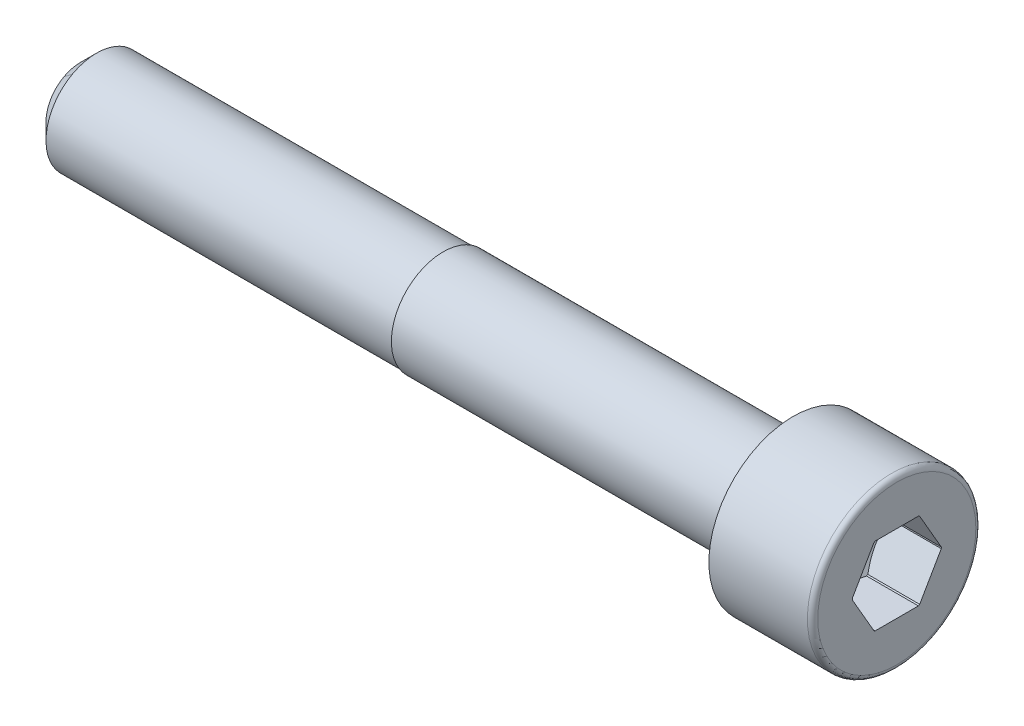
ISO-10303-21;
HEADER;
FILE_DESCRIPTION(('STEP AP214'),'2;1');
FILE_NAME('part.step','',(''),(''),'','','');
FILE_SCHEMA(('AUTOMOTIVE_DESIGN { 1 0 10303 214 1 1 1 1 }'));
ENDSEC;
DATA;
#1=APPLICATION_CONTEXT('core data for automotive mechanical design processes');
#2=APPLICATION_PROTOCOL_DEFINITION('international standard','automotive_design',2000,#1);
#3=PRODUCT_CONTEXT('',#1,'mechanical');
#4=PRODUCT('Part','Part','',(#3));
#5=PRODUCT_RELATED_PRODUCT_CATEGORY('part','',(#4));
#6=PRODUCT_DEFINITION_FORMATION('','',#4);
#7=PRODUCT_DEFINITION_CONTEXT('part definition',#1,'design');
#8=PRODUCT_DEFINITION('design','',#6,#7);
#9=PRODUCT_DEFINITION_SHAPE('','',#8);
#10=(LENGTH_UNIT() NAMED_UNIT(*) SI_UNIT(.MILLI.,.METRE.));
#11=(NAMED_UNIT(*) PLANE_ANGLE_UNIT() SI_UNIT($,.RADIAN.));
#12=(NAMED_UNIT(*) SI_UNIT($,.STERADIAN.) SOLID_ANGLE_UNIT());
#13=UNCERTAINTY_MEASURE_WITH_UNIT(LENGTH_MEASURE(1.E-05),#10,'distance_accuracy_value','');
#14=(GEOMETRIC_REPRESENTATION_CONTEXT(3) GLOBAL_UNCERTAINTY_ASSIGNED_CONTEXT((#13)) GLOBAL_UNIT_ASSIGNED_CONTEXT((#10,
#11,#12)) REPRESENTATION_CONTEXT('',''));
#15=CARTESIAN_POINT('',(0.,0.,0.));
#16=DIRECTION('',(0.,0.,1.));
#17=DIRECTION('',(1.,0.,0.));
#18=AXIS2_PLACEMENT_3D('',#15,#16,#17);
#19=CARTESIAN_POINT('',(5.00941127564,0.,0.));
#20=DIRECTION('',(-1.,0.,0.));
#21=DIRECTION('',(0.,0.,1.));
#22=AXIS2_PLACEMENT_3D('',#19,#20,#21);
#23=CYLINDRICAL_SURFACE('',#22,3.4315);
#24=DIRECTION('',(1.,0.,0.));
#25=VECTOR('',#24,1.);
#26=CARTESIAN_POINT('',(8.,3.,-1.66589082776));
#27=LINE('',#26,#25);
#28=CARTESIAN_POINT('',(4.00000000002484,3.,-1.66589082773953));
#29=VERTEX_POINT('',#28);
#30=CARTESIAN_POINT('',(8.,3.,-1.66589082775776));
#31=VERTEX_POINT('',#30);
#32=EDGE_CURVE('E153',#29,#31,#27,.T.);
#33=ORIENTED_EDGE('',*,*,#32,.F.);
#34=CARTESIAN_POINT('',(4.0000000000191,0.,0.));
#35=DIRECTION('',(1.,0.,0.));
#36=DIRECTION('',(0.,0.479425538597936,0.877582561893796));
#37=AXIS2_PLACEMENT_3D('',#34,#35,#36);
#38=CIRCLE('',#37,3.43149999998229);
#39=CARTESIAN_POINT('',(4.0000000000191,2.94270377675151,-1.76513079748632));
#40=VERTEX_POINT('',#39);
#41=EDGE_CURVE('E148',#29,#40,#38,.F.);
#42=ORIENTED_EDGE('',*,*,#41,.T.);
#43=DIRECTION('',(1.,0.,0.));
#44=VECTOR('',#43,1.);
#45=CARTESIAN_POINT('',(8.,2.94270377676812,-1.76513079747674));
#46=LINE('',#45,#44);
#47=CARTESIAN_POINT('',(8.,2.94270377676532,-1.76513079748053));
#48=VERTEX_POINT('',#47);
#49=EDGE_CURVE('E147',#48,#40,#46,.F.);
#50=ORIENTED_EDGE('',*,*,#49,.F.);
#51=CARTESIAN_POINT('',(8.,0.,0.));
#52=DIRECTION('',(1.,0.,0.));
#53=DIRECTION('',(0.,0.,-1.));
#54=AXIS2_PLACEMENT_3D('',#51,#52,#53);
#55=CIRCLE('',#54,3.4315);
#56=EDGE_CURVE('E132',#31,#48,#55,.F.);
#57=ORIENTED_EDGE('',*,*,#56,.F.);
#58=EDGE_LOOP('',(#33,#42,#50,#57));
#59=FACE_BOUND('',#58,.T.);
#60=ADVANCED_FACE('F16',(#59),#23,.F.);
#61=CARTESIAN_POINT('',(5.00941127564,0.,0.));
#62=DIRECTION('',(-1.,0.,0.));
#63=DIRECTION('',(0.,0.,1.));
#64=AXIS2_PLACEMENT_3D('',#61,#62,#63);
#65=CYLINDRICAL_SURFACE('',#64,3.4315);
#66=DIRECTION('',(1.,0.,0.));
#67=VECTOR('',#66,1.);
#68=CARTESIAN_POINT('',(8.,-0.0572962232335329,-3.43102162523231));
#69=LINE('',#68,#67);
#70=CARTESIAN_POINT('',(8.,-0.057296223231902,-3.43102162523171));
#71=VERTEX_POINT('',#70);
#72=CARTESIAN_POINT('',(4.0000000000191,-0.0572962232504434,-3.43102162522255));
#73=VERTEX_POINT('',#72);
#74=EDGE_CURVE('E392',#71,#73,#69,.F.);
#75=ORIENTED_EDGE('',*,*,#74,.F.);
#76=CARTESIAN_POINT('',(8.,0.,0.));
#77=DIRECTION('',(1.,0.,0.));
#78=DIRECTION('',(0.,0.,-1.));
#79=AXIS2_PLACEMENT_3D('',#76,#77,#78);
#80=CIRCLE('',#79,3.4315);
#81=CARTESIAN_POINT('',(8.,0.0572962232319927,-3.43102162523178));
#82=VERTEX_POINT('',#81);
#83=EDGE_CURVE('E144',#82,#71,#80,.F.);
#84=ORIENTED_EDGE('',*,*,#83,.F.);
#85=DIRECTION('',(1.,0.,0.));
#86=VECTOR('',#85,1.);
#87=CARTESIAN_POINT('',(8.,0.0572962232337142,-3.43102162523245));
#88=LINE('',#87,#86);
#89=CARTESIAN_POINT('',(4.00000000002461,0.0572962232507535,-3.43102162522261));
#90=VERTEX_POINT('',#89);
#91=EDGE_CURVE('E158',#90,#82,#88,.T.);
#92=ORIENTED_EDGE('',*,*,#91,.F.);
#93=CARTESIAN_POINT('',(4.0000000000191,0.,0.));
#94=DIRECTION('',(1.,0.,0.));
#95=DIRECTION('',(0.,0.479425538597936,0.877582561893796));
#96=AXIS2_PLACEMENT_3D('',#93,#94,#95);
#97=CIRCLE('',#96,3.43149999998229);
#98=EDGE_CURVE('E168',#90,#73,#97,.F.);
#99=ORIENTED_EDGE('',*,*,#98,.T.);
#100=EDGE_LOOP('',(#75,#84,#92,#99));
#101=FACE_BOUND('',#100,.T.);
#102=ADVANCED_FACE('F427',(#101),#65,.F.);
#103=CARTESIAN_POINT('',(5.00941127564,0.,0.));
#104=DIRECTION('',(-1.,0.,0.));
#105=DIRECTION('',(0.,0.,1.));
#106=AXIS2_PLACEMENT_3D('',#103,#104,#105);
#107=CYLINDRICAL_SURFACE('',#106,3.4315);
#108=CARTESIAN_POINT('',(4.0000000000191,0.,0.));
#109=DIRECTION('',(1.,0.,0.));
#110=DIRECTION('',(0.,0.479425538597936,0.877582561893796));
#111=AXIS2_PLACEMENT_3D('',#108,#109,#110);
#112=CIRCLE('',#111,3.43149999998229);
#113=CARTESIAN_POINT('',(4.00000000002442,-2.94270377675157,-1.76513079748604));
#114=VERTEX_POINT('',#113);
#115=CARTESIAN_POINT('',(4.0000000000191,-3.,-1.66589082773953));
#116=VERTEX_POINT('',#115);
#117=EDGE_CURVE('E270',#114,#116,#112,.F.);
#118=ORIENTED_EDGE('',*,*,#117,.T.);
#119=DIRECTION('',(1.,0.,0.));
#120=VECTOR('',#119,1.);
#121=CARTESIAN_POINT('',(8.,-3.,-1.66589082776));
#122=LINE('',#121,#120);
#123=CARTESIAN_POINT('',(8.,-3.,-1.66589082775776));
#124=VERTEX_POINT('',#123);
#125=EDGE_CURVE('E241',#124,#116,#122,.F.);
#126=ORIENTED_EDGE('',*,*,#125,.F.);
#127=CARTESIAN_POINT('',(8.,0.,0.));
#128=DIRECTION('',(1.,0.,0.));
#129=DIRECTION('',(0.,0.,-1.));
#130=AXIS2_PLACEMENT_3D('',#127,#128,#129);
#131=CIRCLE('',#130,3.4315);
#132=CARTESIAN_POINT('',(8.,-2.94270377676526,-1.76513079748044));
#133=VERTEX_POINT('',#132);
#134=EDGE_CURVE('E273',#133,#124,#131,.F.);
#135=ORIENTED_EDGE('',*,*,#134,.F.);
#136=DIRECTION('',(1.,0.,0.));
#137=VECTOR('',#136,1.);
#138=CARTESIAN_POINT('',(8.,-2.94270377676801,-1.76513079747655));
#139=LINE('',#138,#137);
#140=EDGE_CURVE('E389',#114,#133,#139,.T.);
#141=ORIENTED_EDGE('',*,*,#140,.F.);
#142=EDGE_LOOP('',(#118,#126,#135,#141));
#143=FACE_BOUND('',#142,.T.);
#144=ADVANCED_FACE('F416',(#143),#107,.F.);
#145=CARTESIAN_POINT('',(5.00941127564,0.,0.));
#146=DIRECTION('',(-1.,0.,0.));
#147=DIRECTION('',(0.,0.,1.));
#148=AXIS2_PLACEMENT_3D('',#145,#146,#147);
#149=CYLINDRICAL_SURFACE('',#148,3.4315);
#150=DIRECTION('',(1.,0.,0.));
#151=VECTOR('',#150,1.);
#152=CARTESIAN_POINT('',(8.,-3.,1.66589082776));
#153=LINE('',#152,#151);
#154=CARTESIAN_POINT('',(4.00000000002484,-3.,1.66589082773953));
#155=VERTEX_POINT('',#154);
#156=CARTESIAN_POINT('',(8.,-3.,1.66589082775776));
#157=VERTEX_POINT('',#156);
#158=EDGE_CURVE('E240',#155,#157,#153,.T.);
#159=ORIENTED_EDGE('',*,*,#158,.F.);
#160=CARTESIAN_POINT('',(4.0000000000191,0.,0.));
#161=DIRECTION('',(1.,0.,0.));
#162=DIRECTION('',(0.,0.479425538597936,0.877582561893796));
#163=AXIS2_PLACEMENT_3D('',#160,#161,#162);
#164=CIRCLE('',#163,3.43149999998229);
#165=CARTESIAN_POINT('',(4.0000000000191,-2.94270377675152,1.76513079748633));
#166=VERTEX_POINT('',#165);
#167=EDGE_CURVE('E406',#155,#166,#164,.F.);
#168=ORIENTED_EDGE('',*,*,#167,.T.);
#169=DIRECTION('',(1.,0.,0.));
#170=VECTOR('',#169,1.);
#171=CARTESIAN_POINT('',(8.,-2.94270377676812,1.76513079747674));
#172=LINE('',#171,#170);
#173=CARTESIAN_POINT('',(8.,-2.94270377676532,1.76513079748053));
#174=VERTEX_POINT('',#173);
#175=EDGE_CURVE('E382',#174,#166,#172,.F.);
#176=ORIENTED_EDGE('',*,*,#175,.F.);
#177=CARTESIAN_POINT('',(8.,0.,0.));
#178=DIRECTION('',(1.,0.,0.));
#179=DIRECTION('',(0.,0.,-1.));
#180=AXIS2_PLACEMENT_3D('',#177,#178,#179);
#181=CIRCLE('',#180,3.4315);
#182=EDGE_CURVE('E271',#157,#174,#181,.F.);
#183=ORIENTED_EDGE('',*,*,#182,.F.);
#184=EDGE_LOOP('',(#159,#168,#176,#183));
#185=FACE_BOUND('',#184,.T.);
#186=ADVANCED_FACE('F441',(#185),#149,.F.);
#187=CARTESIAN_POINT('',(5.00941127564,0.,0.));
#188=DIRECTION('',(-1.,0.,0.));
#189=DIRECTION('',(0.,0.,1.));
#190=AXIS2_PLACEMENT_3D('',#187,#188,#189);
#191=CYLINDRICAL_SURFACE('',#190,3.4315);
#192=DIRECTION('',(1.,0.,0.));
#193=VECTOR('',#192,1.);
#194=CARTESIAN_POINT('',(8.,0.0572962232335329,3.43102162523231));
#195=LINE('',#194,#193);
#196=CARTESIAN_POINT('',(8.,0.057296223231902,3.43102162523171));
#197=VERTEX_POINT('',#196);
#198=CARTESIAN_POINT('',(4.0000000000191,0.0572962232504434,3.43102162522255));
#199=VERTEX_POINT('',#198);
#200=EDGE_CURVE('E197',#197,#199,#195,.F.);
#201=ORIENTED_EDGE('',*,*,#200,.F.);
#202=CARTESIAN_POINT('',(8.,0.,0.));
#203=DIRECTION('',(1.,0.,0.));
#204=DIRECTION('',(0.,0.,-1.));
#205=AXIS2_PLACEMENT_3D('',#202,#203,#204);
#206=CIRCLE('',#205,3.4315);
#207=CARTESIAN_POINT('',(8.,-0.0572962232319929,3.43102162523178));
#208=VERTEX_POINT('',#207);
#209=EDGE_CURVE('E268',#208,#197,#206,.F.);
#210=ORIENTED_EDGE('',*,*,#209,.F.);
#211=DIRECTION('',(1.,0.,0.));
#212=VECTOR('',#211,1.);
#213=CARTESIAN_POINT('',(8.,-0.0572962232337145,3.43102162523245));
#214=LINE('',#213,#212);
#215=CARTESIAN_POINT('',(4.00000000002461,-0.057296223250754,3.43102162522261));
#216=VERTEX_POINT('',#215);
#217=EDGE_CURVE('E379',#216,#208,#214,.T.);
#218=ORIENTED_EDGE('',*,*,#217,.F.);
#219=CARTESIAN_POINT('',(4.0000000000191,0.,0.));
#220=DIRECTION('',(1.,0.,0.));
#221=DIRECTION('',(0.,0.479425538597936,0.877582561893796));
#222=AXIS2_PLACEMENT_3D('',#219,#220,#221);
#223=CIRCLE('',#222,3.43149999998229);
#224=EDGE_CURVE('E169',#216,#199,#223,.F.);
#225=ORIENTED_EDGE('',*,*,#224,.T.);
#226=EDGE_LOOP('',(#201,#210,#218,#225));
#227=FACE_BOUND('',#226,.T.);
#228=ADVANCED_FACE('F213',(#227),#191,.F.);
#229=CARTESIAN_POINT('',(4.0000000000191,0.,0.));
#230=DIRECTION('',(1.,0.,0.));
#231=DIRECTION('',(0.,0.,-1.));
#232=AXIS2_PLACEMENT_3D('',#229,#230,#231);
#233=CONICAL_SURFACE('',#232,3.43149999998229,1.0471975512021);
#234=CARTESIAN_POINT('',(2.02219020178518,-3.92209341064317E-12,2.14264945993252E-12));
#235=VERTEX_POINT('',#234);
#236=VERTEX_LOOP('',#235);
#237=FACE_BOUND('',#236,.T.);
#238=CARTESIAN_POINT('',(4.00000000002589,0.0572962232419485,3.43102162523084));
#239=CARTESIAN_POINT('',(3.96325492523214,0.17081183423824,3.36548335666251));
#240=CARTESIAN_POINT('',(3.929566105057,0.28514686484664,3.29947199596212));
#241=CARTESIAN_POINT('',(3.86970967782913,0.515490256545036,3.16648317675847));
#242=CARTESIAN_POINT('',(3.8435558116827,0.631501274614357,3.09950418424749));
#243=CARTESIAN_POINT('',(3.80077359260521,0.862380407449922,2.96620605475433));
#244=CARTESIAN_POINT('',(3.78395759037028,0.977221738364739,2.899902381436));
#245=CARTESIAN_POINT('',(3.76016083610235,1.20757941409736,2.76690531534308));
#246=CARTESIAN_POINT('',(3.75317159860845,1.32309508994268,2.70021230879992));
#247=CARTESIAN_POINT('',(3.74938304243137,1.56424529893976,2.56098417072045));
#248=CARTESIAN_POINT('',(3.75351627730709,1.68989180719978,2.48844212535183));
#249=CARTESIAN_POINT('',(3.77363673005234,1.94058202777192,2.34370605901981));
#250=CARTESIAN_POINT('',(3.78963616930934,2.06562498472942,2.2715124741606));
#251=CARTESIAN_POINT('',(3.83267808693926,2.31719015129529,2.1262712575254));
#252=CARTESIAN_POINT('',(3.85996753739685,2.4436796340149,2.05324252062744));
#253=CARTESIAN_POINT('',(3.92364198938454,2.69467514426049,1.90833019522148));
#254=CARTESIAN_POINT('',(3.96000827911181,2.81918469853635,1.83644457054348));
#255=CARTESIAN_POINT('',(4.00000000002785,2.94270377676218,1.76513079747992));
#256=B_SPLINE_CURVE_WITH_KNOTS('',3,(#238,#239,#240,#241,#242,#243,#244,#245,#246,#247,#248,
#249,#250,#251,#252,#253,#254,#255),.UNSPECIFIED.,.F.,.F.,(4,2,2,2,2,2,2,2,4),(0.,
0.408481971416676,0.817704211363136,1.21837417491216,1.61869794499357,2.05360864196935,
2.48896789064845,2.93440148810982,3.3789243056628),.UNSPECIFIED.);
#257=CARTESIAN_POINT('',(4.00000000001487,2.94270377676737,1.76513079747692));
#258=VERTEX_POINT('',#257);
#259=EDGE_CURVE('E189',#199,#258,#256,.T.);
#260=ORIENTED_EDGE('',*,*,#259,.F.);
#261=ORIENTED_EDGE('',*,*,#224,.F.);
#262=CARTESIAN_POINT('',(4.00000000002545,-2.94270377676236,1.76513079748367));
#263=CARTESIAN_POINT('',(3.95761571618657,-2.8118234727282,1.84069457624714));
#264=CARTESIAN_POINT('',(3.9193099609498,-2.67981268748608,1.9169110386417));
#265=CARTESIAN_POINT('',(3.85299680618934,-2.41358638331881,2.07061686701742));
#266=CARTESIAN_POINT('',(3.82501189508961,-2.27936670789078,2.14810863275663));
#267=CARTESIAN_POINT('',(3.78220050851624,-2.01256396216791,2.30214726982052));
#268=CARTESIAN_POINT('',(3.76707654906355,-1.88001803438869,2.37867269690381));
#269=CARTESIAN_POINT('',(3.75031731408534,-1.61441682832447,2.53201762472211));
#270=CARTESIAN_POINT('',(3.74866675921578,-1.4813622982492,2.60883669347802));
#271=CARTESIAN_POINT('',(3.75800702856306,-1.240344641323,2.7479883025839));
#272=CARTESIAN_POINT('',(3.76670796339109,-1.13230895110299,2.81036273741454));
#273=CARTESIAN_POINT('',(3.79254998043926,-0.916926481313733,2.93471386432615));
#274=CARTESIAN_POINT('',(3.80969720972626,-0.809580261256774,2.99669023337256));
#275=CARTESIAN_POINT('',(3.8518773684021,-0.593876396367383,3.12122691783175));
#276=CARTESIAN_POINT('',(3.8770609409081,-0.485541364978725,3.18377417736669));
#277=CARTESIAN_POINT('',(3.93394629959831,-0.270335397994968,3.30802340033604));
#278=CARTESIAN_POINT('',(3.96563762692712,-0.163462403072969,3.36972655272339));
#279=CARTESIAN_POINT('',(4.00000000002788,-0.0572962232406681,3.43102162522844));
#280=B_SPLINE_CURVE_WITH_KNOTS('',3,(#262,#263,#264,#265,#266,#267,#268,#269,#270,#271,#272,
#273,#274,#275,#276,#277,#278,#279),.UNSPECIFIED.,.F.,.F.,(4,2,2,2,2,2,2,2,4),(0.,
0.471055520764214,0.943131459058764,1.40396540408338,1.86427667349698,2.23913478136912,
2.61426610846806,2.99688901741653,3.37890174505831),.UNSPECIFIED.);
#281=EDGE_CURVE('E198',#166,#216,#280,.T.);
#282=ORIENTED_EDGE('',*,*,#281,.F.);
#283=ORIENTED_EDGE('',*,*,#167,.F.);
#284=CARTESIAN_POINT('',(4.00000000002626,-3.000000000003,-1.66589082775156));
#285=CARTESIAN_POINT('',(3.95761571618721,-3.00000000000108,-1.51476327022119));
#286=CARTESIAN_POINT('',(3.91930996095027,-3.00000000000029,-1.36233034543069));
#287=CARTESIAN_POINT('',(3.85299680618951,-2.99999999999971,-1.05491868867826));
#288=CARTESIAN_POINT('',(3.82501189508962,-2.99999999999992,-0.899935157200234));
#289=CARTESIAN_POINT('',(3.78220050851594,-3.00000000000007,-0.591857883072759));
#290=CARTESIAN_POINT('',(3.76707654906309,-3.00000000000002,-0.438807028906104));
#291=CARTESIAN_POINT('',(3.75031731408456,-2.99999999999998,-0.132117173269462));
#292=CARTESIAN_POINT('',(3.74866675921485,-2.99999999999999,0.0215209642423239));
#293=CARTESIAN_POINT('',(3.75800702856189,-3.,0.299824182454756));
#294=CARTESIAN_POINT('',(3.76670796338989,-3.,0.424573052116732));
#295=CARTESIAN_POINT('',(3.79254998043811,-3.,0.673275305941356));
#296=CARTESIAN_POINT('',(3.80969720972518,-3.,0.797228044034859));
#297=CARTESIAN_POINT('',(3.85187736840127,-3.,1.04630141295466));
#298=CARTESIAN_POINT('',(3.87706094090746,-3.,1.17139593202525));
#299=CARTESIAN_POINT('',(3.93394629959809,-3.,1.41989437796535));
#300=CARTESIAN_POINT('',(3.96563762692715,-3.,1.54330068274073));
#301=CARTESIAN_POINT('',(4.00000000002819,-3.,1.6658908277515));
#302=B_SPLINE_CURVE_WITH_KNOTS('',3,(#284,#285,#286,#287,#288,#289,#290,#291,#292,#293,#294,
#295,#296,#297,#298,#299,#300,#301),.UNSPECIFIED.,.F.,.F.,(4,2,2,2,2,2,2,2,4),(0.,
0.471055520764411,0.943131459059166,1.40396540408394,1.86427667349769,2.23913478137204,
2.61426610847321,2.99688901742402,3.37890174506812),.UNSPECIFIED.);
#303=EDGE_CURVE('E234',#116,#155,#302,.T.);
#304=ORIENTED_EDGE('',*,*,#303,.F.);
#305=ORIENTED_EDGE('',*,*,#117,.F.);
#306=CARTESIAN_POINT('',(4.00000000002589,-0.0572962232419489,-3.43102162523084));
#307=CARTESIAN_POINT('',(3.96325492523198,-0.170811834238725,-3.36548335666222));
#308=CARTESIAN_POINT('',(3.92956610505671,-0.285146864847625,-3.29947199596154));
#309=CARTESIAN_POINT('',(3.86970967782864,-0.515490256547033,-3.16648317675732));
#310=CARTESIAN_POINT('',(3.84355581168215,-0.631501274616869,-3.09950418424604));
#311=CARTESIAN_POINT('',(3.80077359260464,-0.862380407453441,-2.96620605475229));
#312=CARTESIAN_POINT('',(3.78395759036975,-0.977221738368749,-2.89990238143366));
#313=CARTESIAN_POINT('',(3.76016083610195,-1.20757941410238,-2.7669053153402));
#314=CARTESIAN_POINT('',(3.75317159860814,-1.32309508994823,-2.70021230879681));
#315=CARTESIAN_POINT('',(3.74938304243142,-1.5642452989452,-2.56098417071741));
#316=CARTESIAN_POINT('',(3.75351627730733,-1.68989180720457,-2.4884421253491));
#317=CARTESIAN_POINT('',(3.77363673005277,-1.94058202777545,-2.34370605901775));
#318=CARTESIAN_POINT('',(3.78963616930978,-2.06562498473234,-2.27151247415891));
#319=CARTESIAN_POINT('',(3.83267808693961,-2.31719015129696,-2.12627125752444));
#320=CARTESIAN_POINT('',(3.8599675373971,-2.44367963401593,-2.05324252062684));
#321=CARTESIAN_POINT('',(3.92364198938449,-2.69467514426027,-1.9083301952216));
#322=CARTESIAN_POINT('',(3.96000827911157,-2.81918469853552,-1.83644457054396));
#323=CARTESIAN_POINT('',(4.00000000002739,-2.94270377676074,-1.76513079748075));
#324=B_SPLINE_CURVE_WITH_KNOTS('',3,(#306,#307,#308,#309,#310,#311,#312,#313,#314,#315,#316,
#317,#318,#319,#320,#321,#322,#323),.UNSPECIFIED.,.F.,.F.,(4,2,2,2,2,2,2,2,4),(0.,
0.408481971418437,0.817704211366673,1.2183741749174,1.6186979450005,2.05360864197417,
2.48896789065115,2.93440148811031,3.37892430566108),.UNSPECIFIED.);
#325=EDGE_CURVE('E229',#73,#114,#324,.T.);
#326=ORIENTED_EDGE('',*,*,#325,.F.);
#327=ORIENTED_EDGE('',*,*,#98,.F.);
#328=CARTESIAN_POINT('',(4.00000000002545,2.94270377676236,-1.76513079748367));
#329=CARTESIAN_POINT('',(3.95761571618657,2.8118234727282,-1.84069457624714));
#330=CARTESIAN_POINT('',(3.91930996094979,2.67981268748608,-1.9169110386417));
#331=CARTESIAN_POINT('',(3.85299680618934,2.41358638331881,-2.07061686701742));
#332=CARTESIAN_POINT('',(3.82501189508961,2.27936670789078,-2.14810863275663));
#333=CARTESIAN_POINT('',(3.78220050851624,2.0125639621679,-2.30214726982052));
#334=CARTESIAN_POINT('',(3.76707654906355,1.88001803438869,-2.37867269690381));
#335=CARTESIAN_POINT('',(3.75031731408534,1.61441682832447,-2.53201762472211));
#336=CARTESIAN_POINT('',(3.74866675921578,1.4813622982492,-2.60883669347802));
#337=CARTESIAN_POINT('',(3.75800702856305,1.240344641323,-2.7479883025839));
#338=CARTESIAN_POINT('',(3.76670796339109,1.13230895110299,-2.81036273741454));
#339=CARTESIAN_POINT('',(3.79254998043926,0.916926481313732,-2.93471386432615));
#340=CARTESIAN_POINT('',(3.80969720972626,0.809580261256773,-2.99669023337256));
#341=CARTESIAN_POINT('',(3.8518773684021,0.593876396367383,-3.12122691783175));
#342=CARTESIAN_POINT('',(3.8770609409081,0.485541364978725,-3.18377417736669));
#343=CARTESIAN_POINT('',(3.93394629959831,0.270335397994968,-3.30802340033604));
#344=CARTESIAN_POINT('',(3.96563762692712,0.163462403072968,-3.36972655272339));
#345=CARTESIAN_POINT('',(4.00000000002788,0.0572962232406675,-3.43102162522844));
#346=B_SPLINE_CURVE_WITH_KNOTS('',3,(#328,#329,#330,#331,#332,#333,#334,#335,#336,#337,#338,
#339,#340,#341,#342,#343,#344,#345),.UNSPECIFIED.,.F.,.F.,(4,2,2,2,2,2,2,2,4),(0.,
0.471055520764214,0.943131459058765,1.40396540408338,1.86427667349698,2.23913478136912,
2.61426610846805,2.99688901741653,3.37890174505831),.UNSPECIFIED.);
#347=EDGE_CURVE('E152',#40,#90,#346,.T.);
#348=ORIENTED_EDGE('',*,*,#347,.F.);
#349=ORIENTED_EDGE('',*,*,#41,.F.);
#350=CARTESIAN_POINT('',(4.00000000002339,3.00000000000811,1.66589082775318));
#351=CARTESIAN_POINT('',(3.95761571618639,3.00000000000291,1.51476327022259));
#352=CARTESIAN_POINT('',(3.91930996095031,3.00000000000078,1.36233034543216));
#353=CARTESIAN_POINT('',(3.85299680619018,2.99999999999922,1.05491868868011));
#354=CARTESIAN_POINT('',(3.82501189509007,2.99999999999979,0.899935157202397));
#355=CARTESIAN_POINT('',(3.78220050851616,3.0000000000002,0.591857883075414));
#356=CARTESIAN_POINT('',(3.76707654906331,3.00000000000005,0.438807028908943));
#357=CARTESIAN_POINT('',(3.75031731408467,2.99999999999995,0.132117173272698));
#358=CARTESIAN_POINT('',(3.74866675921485,2.99999999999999,-0.021520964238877));
#359=CARTESIAN_POINT('',(3.75800702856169,3.00000000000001,-0.299824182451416));
#360=CARTESIAN_POINT('',(3.76670796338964,3.,-0.424573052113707));
#361=CARTESIAN_POINT('',(3.7925499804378,3.,-0.673275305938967));
#362=CARTESIAN_POINT('',(3.80969720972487,3.,-0.797228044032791));
#363=CARTESIAN_POINT('',(3.85187736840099,3.,-1.04630141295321));
#364=CARTESIAN_POINT('',(3.87706094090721,3.,-1.1713959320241));
#365=CARTESIAN_POINT('',(3.93394629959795,3.,-1.41989437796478));
#366=CARTESIAN_POINT('',(3.96563762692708,3.,-1.54330068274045));
#367=CARTESIAN_POINT('',(4.00000000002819,3.,-1.6658908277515));
#368=B_SPLINE_CURVE_WITH_KNOTS('',3,(#350,#351,#352,#353,#354,#355,#356,#357,#358,#359,#360,
#361,#362,#363,#364,#365,#366,#367),.UNSPECIFIED.,.F.,.F.,(4,2,2,2,2,2,2,2,4),(0.,
0.471055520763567,0.943131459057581,1.40396540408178,1.86427667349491,2.23913478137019,
2.61426610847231,2.99688901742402,3.378901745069),.UNSPECIFIED.);
#369=CARTESIAN_POINT('',(4.00000000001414,3.,1.6658908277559));
#370=VERTEX_POINT('',#369);
#371=EDGE_CURVE('E258',#370,#29,#368,.T.);
#372=ORIENTED_EDGE('',*,*,#371,.F.);
#373=CARTESIAN_POINT('',(4.,0.,0.));
#374=DIRECTION('',(-1.,0.,0.));
#375=DIRECTION('',(0.,0.,1.));
#376=AXIS2_PLACEMENT_3D('',#373,#374,#375);
#377=CIRCLE('',#376,3.4315);
#378=EDGE_CURVE('E267',#370,#258,#377,.F.);
#379=ORIENTED_EDGE('',*,*,#378,.T.);
#380=EDGE_LOOP('',(#260,#261,#282,#283,#304,#305,#326,#327,#348,#349,#372,#379));
#381=FACE_BOUND('',#380,.T.);
#382=ADVANCED_FACE('F207',(#237,#381),#233,.F.);
#383=CARTESIAN_POINT('',(5.00941127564,0.,0.));
#384=DIRECTION('',(-1.,0.,0.));
#385=DIRECTION('',(0.,0.,1.));
#386=AXIS2_PLACEMENT_3D('',#383,#384,#385);
#387=CYLINDRICAL_SURFACE('',#386,3.4315);
#388=ORIENTED_EDGE('',*,*,#378,.F.);
#389=DIRECTION('',(1.,0.,0.));
#390=VECTOR('',#389,1.);
#391=CARTESIAN_POINT('',(8.,3.,1.66589082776));
#392=LINE('',#391,#390);
#393=CARTESIAN_POINT('',(8.,3.,1.66589082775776));
#394=VERTEX_POINT('',#393);
#395=EDGE_CURVE('E264',#394,#370,#392,.F.);
#396=ORIENTED_EDGE('',*,*,#395,.F.);
#397=CARTESIAN_POINT('',(8.,0.,0.));
#398=DIRECTION('',(1.,0.,0.));
#399=DIRECTION('',(0.,0.,-1.));
#400=AXIS2_PLACEMENT_3D('',#397,#398,#399);
#401=CIRCLE('',#400,3.4315);
#402=CARTESIAN_POINT('',(8.,2.94270377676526,1.76513079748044));
#403=VERTEX_POINT('',#402);
#404=EDGE_CURVE('E265',#403,#394,#401,.F.);
#405=ORIENTED_EDGE('',*,*,#404,.F.);
#406=DIRECTION('',(1.,0.,0.));
#407=VECTOR('',#406,1.);
#408=CARTESIAN_POINT('',(8.,2.94270377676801,1.76513079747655));
#409=LINE('',#408,#407);
#410=EDGE_CURVE('E164',#258,#403,#409,.T.);
#411=ORIENTED_EDGE('',*,*,#410,.F.);
#412=EDGE_LOOP('',(#388,#396,#405,#411));
#413=FACE_BOUND('',#412,.T.);
#414=ADVANCED_FACE('F212',(#413),#387,.F.);
#415=CARTESIAN_POINT('',(8.,3.,-1.73205080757));
#416=DIRECTION('',(0.,-1.,0.));
#417=DIRECTION('',(0.,0.,-1.));
#418=AXIS2_PLACEMENT_3D('',#415,#416,#417);
#419=PLANE('',#418);
#420=ORIENTED_EDGE('',*,*,#371,.T.);
#421=ORIENTED_EDGE('',*,*,#32,.T.);
#422=DIRECTION('',(0.,0.,-1.));
#423=VECTOR('',#422,1.);
#424=CARTESIAN_POINT('',(8.,3.,0.));
#425=LINE('',#424,#423);
#426=EDGE_CURVE('E143',#394,#31,#425,.T.);
#427=ORIENTED_EDGE('',*,*,#426,.F.);
#428=ORIENTED_EDGE('',*,*,#395,.T.);
#429=EDGE_LOOP('',(#420,#421,#427,#428));
#430=FACE_BOUND('',#429,.T.);
#431=ADVANCED_FACE('F254',(#430),#419,.T.);
#432=CARTESIAN_POINT('',(8.,0.,-3.46410161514));
#433=DIRECTION('',(0.,-0.50000000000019,0.866025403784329));
#434=DIRECTION('',(0.,-0.866025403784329,-0.50000000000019));
#435=AXIS2_PLACEMENT_3D('',#432,#433,#434);
#436=PLANE('',#435);
#437=ORIENTED_EDGE('',*,*,#347,.T.);
#438=ORIENTED_EDGE('',*,*,#91,.T.);
#439=DIRECTION('',(0.,-0.866025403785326,-0.499999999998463));
#440=VECTOR('',#439,1.);
#441=CARTESIAN_POINT('',(8.,2.94270377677,-1.76513079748));
#442=LINE('',#441,#440);
#443=EDGE_CURVE('E141',#48,#82,#442,.T.);
#444=ORIENTED_EDGE('',*,*,#443,.F.);
#445=ORIENTED_EDGE('',*,*,#49,.T.);
#446=EDGE_LOOP('',(#437,#438,#444,#445));
#447=FACE_BOUND('',#446,.T.);
#448=ADVANCED_FACE('F156',(#447),#436,.T.);
#449=CARTESIAN_POINT('',(8.,-3.,-1.73205080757));
#450=DIRECTION('',(0.,0.50000000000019,0.866025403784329));
#451=DIRECTION('',(0.,-0.866025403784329,0.50000000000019));
#452=AXIS2_PLACEMENT_3D('',#449,#450,#451);
#453=PLANE('',#452);
#454=ORIENTED_EDGE('',*,*,#325,.T.);
#455=ORIENTED_EDGE('',*,*,#140,.T.);
#456=DIRECTION('',(0.,-0.866025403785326,0.499999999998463));
#457=VECTOR('',#456,1.);
#458=CARTESIAN_POINT('',(8.,-0.0572962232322,-3.43102162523));
#459=LINE('',#458,#457);
#460=EDGE_CURVE('E159',#71,#133,#459,.T.);
#461=ORIENTED_EDGE('',*,*,#460,.F.);
#462=ORIENTED_EDGE('',*,*,#74,.T.);
#463=EDGE_LOOP('',(#454,#455,#461,#462));
#464=FACE_BOUND('',#463,.T.);
#465=ADVANCED_FACE('F246',(#464),#453,.T.);
#466=CARTESIAN_POINT('',(8.,-3.,1.73205080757));
#467=DIRECTION('',(0.,1.,0.));
#468=DIRECTION('',(0.,0.,1.));
#469=AXIS2_PLACEMENT_3D('',#466,#467,#468);
#470=PLANE('',#469);
#471=ORIENTED_EDGE('',*,*,#303,.T.);
#472=ORIENTED_EDGE('',*,*,#158,.T.);
#473=DIRECTION('',(0.,0.,-1.));
#474=VECTOR('',#473,1.);
#475=CARTESIAN_POINT('',(8.,-3.,0.));
#476=LINE('',#475,#474);
#477=EDGE_CURVE('E162',#124,#157,#476,.F.);
#478=ORIENTED_EDGE('',*,*,#477,.F.);
#479=ORIENTED_EDGE('',*,*,#125,.T.);
#480=EDGE_LOOP('',(#471,#472,#478,#479));
#481=FACE_BOUND('',#480,.T.);
#482=ADVANCED_FACE('F242',(#481),#470,.T.);
#483=CARTESIAN_POINT('',(8.,0.,3.46410161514));
#484=DIRECTION('',(0.,0.50000000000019,-0.866025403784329));
#485=DIRECTION('',(0.,0.866025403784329,0.50000000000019));
#486=AXIS2_PLACEMENT_3D('',#483,#484,#485);
#487=PLANE('',#486);
#488=ORIENTED_EDGE('',*,*,#281,.T.);
#489=ORIENTED_EDGE('',*,*,#217,.T.);
#490=DIRECTION('',(0.,0.866025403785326,0.499999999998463));
#491=VECTOR('',#490,1.);
#492=CARTESIAN_POINT('',(8.,-2.94270377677,1.76513079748));
#493=LINE('',#492,#491);
#494=EDGE_CURVE('E403',#174,#208,#493,.T.);
#495=ORIENTED_EDGE('',*,*,#494,.F.);
#496=ORIENTED_EDGE('',*,*,#175,.T.);
#497=EDGE_LOOP('',(#488,#489,#495,#496));
#498=FACE_BOUND('',#497,.T.);
#499=ADVANCED_FACE('F245',(#498),#487,.T.);
#500=CARTESIAN_POINT('',(8.,3.,1.73205080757));
#501=DIRECTION('',(0.,-0.50000000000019,-0.866025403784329));
#502=DIRECTION('',(0.,0.866025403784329,-0.50000000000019));
#503=AXIS2_PLACEMENT_3D('',#500,#501,#502);
#504=PLANE('',#503);
#505=ORIENTED_EDGE('',*,*,#259,.T.);
#506=ORIENTED_EDGE('',*,*,#410,.T.);
#507=DIRECTION('',(0.,0.866025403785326,-0.499999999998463));
#508=VECTOR('',#507,1.);
#509=CARTESIAN_POINT('',(8.,0.0572962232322,3.43102162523));
#510=LINE('',#509,#508);
#511=EDGE_CURVE('E400',#197,#403,#510,.T.);
#512=ORIENTED_EDGE('',*,*,#511,.F.);
#513=ORIENTED_EDGE('',*,*,#200,.T.);
#514=EDGE_LOOP('',(#505,#506,#512,#513));
#515=FACE_BOUND('',#514,.T.);
#516=ADVANCED_FACE('F204',(#515),#504,.T.);
#517=CARTESIAN_POINT('',(8.,0.,0.));
#518=DIRECTION('',(1.,0.,0.));
#519=DIRECTION('',(0.,0.,-1.));
#520=AXIS2_PLACEMENT_3D('',#517,#518,#519);
#521=PLANE('',#520);
#522=ORIENTED_EDGE('',*,*,#511,.T.);
#523=ORIENTED_EDGE('',*,*,#404,.T.);
#524=ORIENTED_EDGE('',*,*,#426,.T.);
#525=ORIENTED_EDGE('',*,*,#56,.T.);
#526=ORIENTED_EDGE('',*,*,#443,.T.);
#527=ORIENTED_EDGE('',*,*,#83,.T.);
#528=ORIENTED_EDGE('',*,*,#460,.T.);
#529=ORIENTED_EDGE('',*,*,#134,.T.);
#530=ORIENTED_EDGE('',*,*,#477,.T.);
#531=ORIENTED_EDGE('',*,*,#182,.T.);
#532=ORIENTED_EDGE('',*,*,#494,.T.);
#533=ORIENTED_EDGE('',*,*,#209,.T.);
#534=EDGE_LOOP('',(#522,#523,#524,#525,#526,#527,#528,#529,#530,#531,#532,#533));
#535=FACE_BOUND('',#534,.T.);
#536=CARTESIAN_POINT('',(8.,0.,0.));
#537=DIRECTION('',(-1.,0.,0.));
#538=DIRECTION('',(0.,1.,0.));
#539=AXIS2_PLACEMENT_3D('',#536,#537,#538);
#540=CIRCLE('',#539,6.1);
#541=CARTESIAN_POINT('',(8.,6.1,0.));
#542=VERTEX_POINT('',#541);
#543=CARTESIAN_POINT('',(8.,-6.1,0.));
#544=VERTEX_POINT('',#543);
#545=EDGE_CURVE('E188',#542,#544,#540,.T.);
#546=ORIENTED_EDGE('',*,*,#545,.F.);
#547=CARTESIAN_POINT('',(8.,0.,0.));
#548=DIRECTION('',(-1.,0.,0.));
#549=DIRECTION('',(0.,-1.,0.));
#550=AXIS2_PLACEMENT_3D('',#547,#548,#549);
#551=CIRCLE('',#550,6.1);
#552=EDGE_CURVE('E402',#544,#542,#551,.T.);
#553=ORIENTED_EDGE('',*,*,#552,.F.);
#554=EDGE_LOOP('',(#546,#553));
#555=FACE_BOUND('',#554,.T.);
#556=ADVANCED_FACE('F138',(#535,#555),#521,.T.);
#557=CARTESIAN_POINT('',(-55.,3.90243902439,0.));
#558=DIRECTION('',(1.,0.,0.));
#559=DIRECTION('',(0.,0.,-1.));
#560=AXIS2_PLACEMENT_3D('',#557,#558,#559);
#561=PLANE('',#560);
#562=CARTESIAN_POINT('',(-55.0000000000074,0.,-1.38931869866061E-13));
#563=DIRECTION('',(1.,0.,1.12229698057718E-13));
#564=DIRECTION('',(1.12229698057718E-13,0.,-1.));
#565=AXIS2_PLACEMENT_3D('',#562,#563,#564);
#566=CIRCLE('',#565,2.65243902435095);
#567=CARTESIAN_POINT('',(-54.9999999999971,-2.32773423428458,-1.27164700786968));
#568=VERTEX_POINT('',#567);
#569=CARTESIAN_POINT('',(-54.9999999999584,2.32773423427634,1.2716470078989));
#570=VERTEX_POINT('',#569);
#571=EDGE_CURVE('E181',#568,#570,#566,.T.);
#572=ORIENTED_EDGE('',*,*,#571,.F.);
#573=CARTESIAN_POINT('',(-54.9999999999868,0.,0.));
#574=DIRECTION('',(1.,0.,0.));
#575=DIRECTION('',(0.,0.,-1.));
#576=AXIS2_PLACEMENT_3D('',#573,#574,#575);
#577=CIRCLE('',#576,2.65243902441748);
#578=EDGE_CURVE('E186',#570,#568,#577,.T.);
#579=ORIENTED_EDGE('',*,*,#578,.F.);
#580=EDGE_LOOP('',(#572,#579));
#581=FACE_BOUND('',#580,.T.);
#582=ADVANCED_FACE('F359',(#581),#561,.F.);
#583=CARTESIAN_POINT('',(7.6,0.,0.));
#584=DIRECTION('',(1.,0.,0.));
#585=DIRECTION('',(0.,-0.982387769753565,0.186853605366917));
#586=AXIS2_PLACEMENT_3D('',#583,#584,#585);
#587=TOROIDAL_SURFACE('',#586,6.1,0.4);
#588=CARTESIAN_POINT('',(7.6,0.,0.));
#589=DIRECTION('',(1.,0.,0.));
#590=DIRECTION('',(0.,0.,-1.));
#591=AXIS2_PLACEMENT_3D('',#588,#589,#590);
#592=CIRCLE('',#591,6.5);
#593=CARTESIAN_POINT('',(7.6,0.,-6.5));
#594=VERTEX_POINT('',#593);
#595=EDGE_CURVE('E335',#594,#594,#592,.F.);
#596=ORIENTED_EDGE('',*,*,#595,.F.);
#597=EDGE_LOOP('',(#596));
#598=FACE_BOUND('',#597,.T.);
#599=ORIENTED_EDGE('',*,*,#545,.T.);
#600=ORIENTED_EDGE('',*,*,#552,.T.);
#601=EDGE_LOOP('',(#599,#600));
#602=FACE_BOUND('',#601,.T.);
#603=ADVANCED_FACE('F353',(#598,#602),#587,.T.);
#604=CARTESIAN_POINT('',(-53.7499999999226,0.,0.));
#605=DIRECTION('',(1.,0.,0.));
#606=DIRECTION('',(0.,0.,-1.));
#607=AXIS2_PLACEMENT_3D('',#604,#605,#606);
#608=CONICAL_SURFACE('',#607,3.90243902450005,0.785398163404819);
#609=DIRECTION('',(-0.707106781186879,0.620544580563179,0.33900504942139));
#610=VECTOR('',#609,1.);
#611=CARTESIAN_POINT('',(499000.00000002,-437964.293157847,-239260.98381527));
#612=LINE('',#611,#610);
#613=CARTESIAN_POINT('',(-53.7500000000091,-3.42471243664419,-1.87092893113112));
#614=VERTEX_POINT('',#613);
#615=EDGE_CURVE('E185',#614,#568,#612,.T.);
#616=ORIENTED_EDGE('',*,*,#615,.F.);
#617=CARTESIAN_POINT('',(-53.75,0.,0.));
#618=DIRECTION('',(1.,0.,0.));
#619=DIRECTION('',(0.,0.,-1.));
#620=AXIS2_PLACEMENT_3D('',#617,#618,#619);
#621=CIRCLE('',#620,3.90243902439);
#622=CARTESIAN_POINT('',(-53.7500000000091,3.42471243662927,1.87092893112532));
#623=VERTEX_POINT('',#622);
#624=EDGE_CURVE('E327',#623,#614,#621,.T.);
#625=ORIENTED_EDGE('',*,*,#624,.F.);
#626=DIRECTION('',(-0.707106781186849,-0.620544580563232,-0.339005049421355));
#627=VECTOR('',#626,1.);
#628=CARTESIAN_POINT('',(498999.999999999,437964.293157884,239260.983815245));
#629=LINE('',#628,#627);
#630=EDGE_CURVE('E184',#570,#623,#629,.F.);
#631=ORIENTED_EDGE('',*,*,#630,.F.);
#632=ORIENTED_EDGE('',*,*,#578,.T.);
#633=EDGE_LOOP('',(#616,#625,#631,#632));
#634=FACE_BOUND('',#633,.T.);
#635=ADVANCED_FACE('F358',(#634),#608,.T.);
#636=CARTESIAN_POINT('',(-53.7499999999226,0.,0.));
#637=DIRECTION('',(1.,0.,1.12229698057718E-13));
#638=DIRECTION('',(1.12229698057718E-13,0.,-1.));
#639=AXIS2_PLACEMENT_3D('',#636,#637,#638);
#640=CONICAL_SURFACE('',#639,3.90243902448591,0.785398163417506);
#641=ORIENTED_EDGE('',*,*,#630,.T.);
#642=CARTESIAN_POINT('',(-53.75,0.,0.));
#643=DIRECTION('',(1.,0.,0.));
#644=DIRECTION('',(0.,0.,-1.));
#645=AXIS2_PLACEMENT_3D('',#642,#643,#644);
#646=CIRCLE('',#645,3.90243902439);
#647=EDGE_CURVE('E180',#614,#623,#646,.T.);
#648=ORIENTED_EDGE('',*,*,#647,.F.);
#649=ORIENTED_EDGE('',*,*,#615,.T.);
#650=ORIENTED_EDGE('',*,*,#571,.T.);
#651=EDGE_LOOP('',(#641,#648,#649,#650));
#652=FACE_BOUND('',#651,.T.);
#653=ADVANCED_FACE('F468',(#652),#640,.T.);
#654=CARTESIAN_POINT('',(4.,0.,0.));
#655=DIRECTION('',(1.,0.,0.));
#656=DIRECTION('',(0.,0.,-1.));
#657=AXIS2_PLACEMENT_3D('',#654,#655,#656);
#658=CYLINDRICAL_SURFACE('',#657,6.5);
#659=CARTESIAN_POINT('',(0.,0.,0.));
#660=DIRECTION('',(1.,0.,0.));
#661=DIRECTION('',(0.,0.,-1.));
#662=AXIS2_PLACEMENT_3D('',#659,#660,#661);
#663=CIRCLE('',#662,6.5);
#664=CARTESIAN_POINT('',(0.,0.,-6.5));
#665=VERTEX_POINT('',#664);
#666=EDGE_CURVE('E177',#665,#665,#663,.T.);
#667=ORIENTED_EDGE('',*,*,#666,.T.);
#668=EDGE_LOOP('',(#667));
#669=FACE_BOUND('',#668,.T.);
#670=ORIENTED_EDGE('',*,*,#595,.T.);
#671=EDGE_LOOP('',(#670));
#672=FACE_BOUND('',#671,.T.);
#673=ADVANCED_FACE('F465',(#669,#672),#658,.T.);
#674=CARTESIAN_POINT('',(-27.5,0.,0.));
#675=DIRECTION('',(1.,0.,0.));
#676=DIRECTION('',(0.,0.,-1.));
#677=AXIS2_PLACEMENT_3D('',#674,#675,#676);
#678=CYLINDRICAL_SURFACE('',#677,3.90243902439);
#679=CARTESIAN_POINT('',(-27.,0.,0.));
#680=DIRECTION('',(1.,0.,0.));
#681=DIRECTION('',(0.,0.,-1.));
#682=AXIS2_PLACEMENT_3D('',#679,#680,#681);
#683=CIRCLE('',#682,3.90243902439);
#684=CARTESIAN_POINT('',(-27.,0.,-3.90243902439));
#685=VERTEX_POINT('',#684);
#686=EDGE_CURVE('E174',#685,#685,#683,.F.);
#687=ORIENTED_EDGE('',*,*,#686,.T.);
#688=EDGE_LOOP('',(#687));
#689=FACE_BOUND('',#688,.T.);
#690=ORIENTED_EDGE('',*,*,#647,.T.);
#691=ORIENTED_EDGE('',*,*,#624,.T.);
#692=EDGE_LOOP('',(#690,#691));
#693=FACE_BOUND('',#692,.T.);
#694=ADVANCED_FACE('F313',(#689,#693),#678,.T.);
#695=CARTESIAN_POINT('',(0.,0.,0.));
#696=DIRECTION('',(1.,0.,0.));
#697=DIRECTION('',(0.,0.,-1.));
#698=AXIS2_PLACEMENT_3D('',#695,#696,#697);
#699=PLANE('',#698);
#700=CARTESIAN_POINT('',(0.,-3.86136327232,-2.10947236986));
#701=CARTESIAN_POINT('',(-1.21326209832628E-09,-3.89670172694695,-2.04478571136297));
#702=CARTESIAN_POINT('',(1.32699959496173E-09,-3.93042770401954,-1.97921930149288));
#703=CARTESIAN_POINT('',(-7.12735852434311E-09,-3.99457332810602,-1.84649032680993));
#704=CARTESIAN_POINT('',(-1.81216944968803E-08,-4.02499304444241,-1.779327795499));
#705=CARTESIAN_POINT('',(-7.46854945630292E-08,-4.08244629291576,-1.64356712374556));
#706=CARTESIAN_POINT('',(-1.202549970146E-07,-4.10947982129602,-1.57496898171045));
#707=CARTESIAN_POINT('',(-3.20920917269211E-07,-4.15378429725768,-1.45382914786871));
#708=CARTESIAN_POINT('',(-4.4579385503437E-07,-4.1718064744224,-1.40155985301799));
#709=CARTESIAN_POINT('',(-7.86529103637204E-07,-4.2172069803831,-1.26125175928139));
#710=CARTESIAN_POINT('',(-1.00749011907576E-06,-4.24280088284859,-1.17262518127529));
#711=CARTESIAN_POINT('',(-1.0300873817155E-06,-4.28365374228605,-1.01179618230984));
#712=CARTESIAN_POINT('',(-9.06770496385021E-07,-4.29995593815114,-0.939855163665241));
#713=CARTESIAN_POINT('',(-5.3292816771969E-07,-4.32884272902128,-0.795237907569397));
#714=CARTESIAN_POINT('',(-2.82427293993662E-07,-4.34142804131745,-0.722561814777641));
#715=CARTESIAN_POINT('',(-5.71283371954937E-08,-4.35745076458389,-0.613144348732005));
#716=CARTESIAN_POINT('',(-7.10279568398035E-09,-4.36231562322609,-0.576606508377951));
#717=CARTESIAN_POINT('',(7.61830537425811E-09,-4.37147723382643,-0.500768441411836));
#718=CARTESIAN_POINT('',(-3.41427618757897E-08,-4.3757071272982,-0.461460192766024));
#719=CARTESIAN_POINT('',(-3.66066068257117E-08,-4.38286922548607,-0.387865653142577));
#720=CARTESIAN_POINT('',(-7.11556703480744E-09,-4.38589857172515,-0.353588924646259));
#721=CARTESIAN_POINT('',(3.90583594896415E-10,-4.38977859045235,-0.301263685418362));
#722=CARTESIAN_POINT('',(-3.79577842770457E-09,-4.39098059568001,-0.283241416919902));
#723=CARTESIAN_POINT('',(-1.20997763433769E-08,-4.39467156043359,-0.222194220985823));
#724=CARTESIAN_POINT('',(-8.07975304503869E-09,-4.39663511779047,-0.179137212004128));
#725=CARTESIAN_POINT('',(-1.79925324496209E-09,-4.40006944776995,-0.0677335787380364));
#726=CARTESIAN_POINT('',(-1.95073942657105E-09,-4.40057699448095,0.000645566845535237));
#727=CARTESIAN_POINT('',(-1.07862606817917E-09,-4.39882372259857,0.111157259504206));
#728=CARTESIAN_POINT('',(-4.82991294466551E-10,-4.39754902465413,0.153308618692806));
#729=CARTESIAN_POINT('',(4.56145495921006E-12,-4.39398116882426,0.233340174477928));
#730=CARTESIAN_POINT('',(-3.90380253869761E-11,-4.39180275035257,0.271225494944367));
#731=CARTESIAN_POINT('',(-6.36076075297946E-11,-4.38558392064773,0.359540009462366));
#732=CARTESIAN_POINT('',(-1.88740710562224E-11,-4.38116496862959,0.409943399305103));
#733=CARTESIAN_POINT('',(-7.86326895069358E-10,-4.37350339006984,0.4829173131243));
#734=CARTESIAN_POINT('',(-1.14114858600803E-09,-4.37094865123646,0.505562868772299));
#735=CARTESIAN_POINT('',(-2.77955428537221E-09,-4.35854622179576,0.608298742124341));
#736=CARTESIAN_POINT('',(-4.13237144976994E-09,-4.3466608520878,0.688155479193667));
#737=CARTESIAN_POINT('',(-4.79769468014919E-09,-4.31850731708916,0.847085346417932));
#738=CARTESIAN_POINT('',(-4.11019859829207E-09,-4.30223914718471,0.926158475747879));
#739=CARTESIAN_POINT('',(-1.700764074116E-09,-4.26536392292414,1.08328789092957));
#740=CARTESIAN_POINT('',(2.11668627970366E-11,-4.24475690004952,1.16134418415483));
#741=CARTESIAN_POINT('',(-2.09989569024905E-11,-4.19945986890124,1.31559066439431));
#742=CARTESIAN_POINT('',(-1.75760412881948E-09,-4.17480347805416,1.39179073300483));
#743=CARTESIAN_POINT('',(-5.44383355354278E-09,-4.1213803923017,1.54273546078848));
#744=CARTESIAN_POINT('',(-7.39345571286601E-09,-4.09261373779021,1.61748013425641));
#745=CARTESIAN_POINT('',(-9.68641029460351E-09,-4.03105215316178,1.7652913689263));
#746=CARTESIAN_POINT('',(-1.00297494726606E-08,-3.99825723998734,1.83835793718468));
#747=CARTESIAN_POINT('',(-8.87258426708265E-09,-3.92873729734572,1.98259703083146));
#748=CARTESIAN_POINT('',(-7.37207727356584E-09,-3.89201226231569,2.05376955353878));
#749=CARTESIAN_POINT('',(-3.70520613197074E-09,-3.81474019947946,2.19400909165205));
#750=CARTESIAN_POINT('',(-1.5388372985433E-09,-3.77419314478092,2.2630760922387));
#751=CARTESIAN_POINT('',(3.8428376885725E-10,-3.68939872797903,2.39890201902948));
#752=CARTESIAN_POINT('',(1.41005502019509E-10,-3.64515131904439,2.46566091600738));
#753=CARTESIAN_POINT('',(-5.7587788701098E-09,-3.55621082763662,2.59221232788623));
#754=CARTESIAN_POINT('',(-1.10462575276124E-08,-3.51175241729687,2.65216993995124));
#755=CARTESIAN_POINT('',(-2.24172395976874E-08,-3.4198370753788,2.76974297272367));
#756=CARTESIAN_POINT('',(-2.85007533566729E-08,-3.37238010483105,2.82735836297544));
#757=CARTESIAN_POINT('',(-3.94975658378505E-08,-3.27459320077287,2.94009785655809));
#758=CARTESIAN_POINT('',(-4.44108541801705E-08,-3.22426324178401,2.99522193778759));
#759=CARTESIAN_POINT('',(-5.15824023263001E-08,-3.12086057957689,3.10283524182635));
#760=CARTESIAN_POINT('',(-5.38406495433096E-08,-3.06778786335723,3.15532445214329));
#761=CARTESIAN_POINT('',(-5.51379310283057E-08,-2.95903779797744,3.25753153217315));
#762=CARTESIAN_POINT('',(-5.41769633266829E-08,-2.90336044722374,3.30724940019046));
#763=CARTESIAN_POINT('',(-4.92744502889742E-08,-2.78954591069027,3.40378463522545));
#764=CARTESIAN_POINT('',(-4.53329154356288E-08,-2.73140873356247,3.45060201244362));
#765=CARTESIAN_POINT('',(-3.5542811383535E-08,-2.61282545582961,3.54121407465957));
#766=CARTESIAN_POINT('',(-2.96942567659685E-08,-2.5523793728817,3.58500878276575));
#767=CARTESIAN_POINT('',(-1.79880836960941E-08,-2.4293365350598,3.66946349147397));
#768=CARTESIAN_POINT('',(-1.21304653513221E-08,-2.36673980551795,3.71012352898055));
#769=CARTESIAN_POINT('',(-3.13845928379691E-09,-2.23955456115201,3.78819649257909));
#770=CARTESIAN_POINT('',(-4.02825258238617E-12,-2.17496607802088,3.82560947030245));
#771=CARTESIAN_POINT('',(3.97615756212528E-12,-2.04483090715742,3.89665182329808));
#772=CARTESIAN_POINT('',(-3.04151098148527E-09,-1.97930762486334,3.93032409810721));
#773=CARTESIAN_POINT('',(8.40814710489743E-10,-1.84667292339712,3.99437327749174));
#774=CARTESIAN_POINT('',(7.76825408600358E-09,-1.77956156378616,4.02475030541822));
#775=CARTESIAN_POINT('',(-1.49390226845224E-08,-1.64391673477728,4.0821406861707));
#776=CARTESIAN_POINT('',(-4.45733172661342E-08,-1.57538328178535,4.10915407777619));
#777=CARTESIAN_POINT('',(-1.11275185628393E-07,-1.43704327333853,4.15970770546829));
#778=CARTESIAN_POINT('',(-1.48342866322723E-07,-1.3672366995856,4.18324789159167));
#779=CARTESIAN_POINT('',(-4.5927700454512E-07,-1.27682261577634,4.21135313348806));
#780=CARTESIAN_POINT('',(-5.45099036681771E-07,-1.25668683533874,4.21746204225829));
#781=CARTESIAN_POINT('',(-5.68293731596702E-07,-1.21834444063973,4.22870370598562));
#782=CARTESIAN_POINT('',(-5.19788090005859E-07,-1.20014844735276,4.23387272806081));
#783=CARTESIAN_POINT('',(-2.90501848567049E-07,-1.1019423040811,4.26110322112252));
#784=CARTESIAN_POINT('',(-2.18240846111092E-07,-1.02133581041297,4.28107333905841));
#785=CARTESIAN_POINT('',(-9.87991028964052E-08,-0.885748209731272,4.31057191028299));
#786=CARTESIAN_POINT('',(-5.1170962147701E-08,-0.831039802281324,4.32137619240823));
#787=CARTESIAN_POINT('',(-1.66613787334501E-08,-0.746950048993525,4.33636055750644));
#788=CARTESIAN_POINT('',(-1.17824190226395E-08,-0.717697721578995,4.34127441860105));
#789=CARTESIAN_POINT('',(3.74350698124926E-10,-0.612665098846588,4.35784878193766));
#790=CARTESIAN_POINT('',(-7.99583296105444E-10,-0.536615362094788,4.36786009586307));
#791=CARTESIAN_POINT('',(-1.83592341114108E-09,-0.402709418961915,4.38195049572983));
#792=CARTESIAN_POINT('',(-1.94841344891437E-09,-0.344940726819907,4.38688095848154));
#793=CARTESIAN_POINT('',(-3.29119274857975E-09,-0.252882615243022,4.39291268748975));
#794=CARTESIAN_POINT('',(-4.04617561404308E-09,-0.218640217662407,4.39475543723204));
#795=CARTESIAN_POINT('',(-6.47005127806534E-09,-0.104444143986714,4.39956035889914));
#796=CARTESIAN_POINT('',(-8.01554765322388E-09,-0.0244071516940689,4.40073995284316));
#797=CARTESIAN_POINT('',(-1.04243425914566E-08,0.135606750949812,4.39872922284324));
#798=CARTESIAN_POINT('',(-1.12876386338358E-08,0.215583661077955,4.39553888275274));
#799=CARTESIAN_POINT('',(-1.18562832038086E-08,0.375245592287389,4.38479753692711));
#800=CARTESIAN_POINT('',(-1.15616310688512E-08,0.454930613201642,4.37724652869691));
#801=CARTESIAN_POINT('',(-9.96535591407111E-09,0.61376925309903,4.35780624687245));
#802=CARTESIAN_POINT('',(-8.6637354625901E-09,0.692922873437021,4.34591698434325));
#803=CARTESIAN_POINT('',(-5.63136028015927E-09,0.850462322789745,4.31783646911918));
#804=CARTESIAN_POINT('',(-3.90060798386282E-09,0.928848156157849,4.30164524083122));
#805=CARTESIAN_POINT('',(-1.09155299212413E-09,1.08462037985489,4.26500622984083));
#806=CARTESIAN_POINT('',(-1.32445578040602E-11,1.16200677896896,4.24455848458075));
#807=CARTESIAN_POINT('',(9.85331563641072E-12,1.29588337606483,4.2052500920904));
#808=CARTESIAN_POINT('',(-5.69734680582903E-10,1.35265010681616,4.18732382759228));
#809=CARTESIAN_POINT('',(-1.98054322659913E-09,1.47134450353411,4.1471808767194));
#810=CARTESIAN_POINT('',(-2.83182067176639E-09,1.53318688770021,4.12471123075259));
#811=CARTESIAN_POINT('',(-4.33848048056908E-09,1.66163925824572,4.07475461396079));
#812=CARTESIAN_POINT('',(-4.9675057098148E-09,1.72814278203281,4.04699365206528));
#813=CARTESIAN_POINT('',(-5.76240102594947E-09,1.86542495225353,3.98568984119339));
#814=CARTESIAN_POINT('',(-5.88326987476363E-09,1.93607286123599,3.95185418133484));
#815=CARTESIAN_POINT('',(-5.61006206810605E-09,2.08104196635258,3.87760562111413));
#816=CARTESIAN_POINT('',(-5.17404078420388E-09,2.15520522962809,3.8368831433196));
#817=CARTESIAN_POINT('',(-4.27469098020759E-09,2.26661489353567,3.77146326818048));
#818=CARTESIAN_POINT('',(-3.92146761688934E-09,2.30475781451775,3.74827831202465));
#819=CARTESIAN_POINT('',(-3.16739134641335E-09,2.38164765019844,3.69992495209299));
#820=CARTESIAN_POINT('',(-2.76530233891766E-09,2.4203688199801,3.67471550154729));
#821=CARTESIAN_POINT('',(-1.97567595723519E-09,2.49829654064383,3.62221540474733));
#822=CARTESIAN_POINT('',(-1.58909350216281E-09,2.53747507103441,3.59488318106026));
#823=CARTESIAN_POINT('',(-8.79240298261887E-10,2.61619133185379,3.53804181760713));
#824=CARTESIAN_POINT('',(-5.58460167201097E-10,2.6556987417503,3.50849068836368));
#825=CARTESIAN_POINT('',(-1.54214149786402E-10,2.73493557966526,3.44711638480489));
#826=CARTESIAN_POINT('',(-7.86034292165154E-11,2.77463225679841,3.415250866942));
#827=CARTESIAN_POINT('',(5.69206912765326E-11,2.84210246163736,3.35914585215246));
#828=CARTESIAN_POINT('',(1.15410646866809E-10,2.87014430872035,3.33522750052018));
#829=CARTESIAN_POINT('',(-2.42022820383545E-09,2.95336247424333,3.26243704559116));
#830=CARTESIAN_POINT('',(-7.72493835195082E-09,3.00763692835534,3.21252518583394));
#831=CARTESIAN_POINT('',(-4.10821135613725E-08,3.1136227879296,3.11006114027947));
#832=CARTESIAN_POINT('',(-6.91344356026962E-08,3.16533420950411,3.05750897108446));
#833=CARTESIAN_POINT('',(-2.48197803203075E-07,3.27868555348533,2.93644416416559));
#834=CARTESIAN_POINT('',(-4.28189774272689E-07,3.33957643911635,2.86722540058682));
#835=CARTESIAN_POINT('',(-8.01694737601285E-07,3.43342528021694,2.75349546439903));
#836=CARTESIAN_POINT('',(-9.61071836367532E-07,3.467823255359,2.71016239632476));
#837=CARTESIAN_POINT('',(-1.16467968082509E-06,3.54608625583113,2.60753256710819));
#838=CARTESIAN_POINT('',(-1.1528642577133E-06,3.58928767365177,2.54772676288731));
#839=CARTESIAN_POINT('',(-9.04831243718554E-07,3.67254172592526,2.42598128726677));
#840=CARTESIAN_POINT('',(-6.68653376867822E-07,3.71259491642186,2.36404199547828));
#841=CARTESIAN_POINT('',(-2.37313756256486E-07,3.78944472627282,2.238195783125));
#842=CARTESIAN_POINT('',(-4.21420636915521E-08,3.82624213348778,2.1742893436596));
#843=CARTESIAN_POINT('',(0.,3.86136327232,2.10947236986));
#844=B_SPLINE_CURVE_WITH_KNOTS('',3,(#700,#701,#702,#703,#704,#705,#706,#707,#708,#709,#710,
#711,#712,#713,#714,#715,#716,#717,#718,#719,#720,#721,#722,#723,#724,#725,#726,#727,#728,#729,
#730,#731,#732,#733,#734,#735,#736,#737,#738,#739,#740,#741,#742,#743,#744,#745,#746,#747,#748,
#749,#750,#751,#752,#753,#754,#755,#756,#757,#758,#759,#760,#761,#762,#763,#764,#765,#766,#767,
#768,#769,#770,#771,#772,#773,#774,#775,#776,#777,#778,#779,#780,#781,#782,#783,#784,#785,#786,
#787,#788,#789,#790,#791,#792,#793,#794,#795,#796,#797,#798,#799,#800,#801,#802,#803,#804,#805,
#806,#807,#808,#809,#810,#811,#812,#813,#814,#815,#816,#817,#818,#819,#820,#821,#822,#823,#824,
#825,#826,#827,#828,#829,#830,#831,#832,#833,#834,#835,#836,#837,#838,#839,#840,#841,#842,#843),
.UNSPECIFIED.,.F.,.F.,(4,2,2,2,2,2,2,2,2,2,2,2,2,2,2,2,2,2,2,2,2,2,2,2,2,2,2,2,2,2,2,2,2,2,2,2,
2,2,2,2,2,2,2,2,2,2,2,2,2,2,2,2,2,2,2,2,2,2,2,2,2,2,2,2,2,2,2,2,2,2,2,4),(0.,0.221105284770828,
0.442205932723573,0.663306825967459,0.829143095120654,1.10567241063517,1.32687885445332,
1.5480425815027,1.65861319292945,1.77720883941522,1.88043034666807,1.93461557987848,
2.06390349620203,2.2689622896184,2.39545872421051,2.50929097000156,2.66104593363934,
2.72941258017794,2.97148178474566,3.21355124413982,3.4556189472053,3.69577015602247,
3.9359190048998,4.17606684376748,4.41621502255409,4.65636489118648,4.89651779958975,
5.12034899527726,5.34418310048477,5.56801919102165,5.79185634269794,6.01569363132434,
6.23953013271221,6.46336492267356,6.68719707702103,6.91102567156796,7.13194166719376,
7.3528493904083,7.57375456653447,7.79466292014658,7.85778694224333,7.9145336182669,
8.16350711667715,8.33076382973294,8.41974679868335,8.64974650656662,8.82363797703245,
8.92650715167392,9.1665119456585,9.40651762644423,9.64652344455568,9.88652865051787,
10.1265324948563,10.366534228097,10.5450788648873,10.7424056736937,10.9585140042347,
11.1934032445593,11.4470728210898,11.5809655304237,11.7195548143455,11.8628407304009,
12.0108233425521,12.1635027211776,12.2740649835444,12.4951684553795,12.716270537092,
12.9926370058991,13.1585819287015,13.3798084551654,13.6009958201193,13.8221295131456),.UNSPECIFIED.);
#845=CARTESIAN_POINT('',(0.,-3.86136327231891,-2.10947236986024));
#846=VERTEX_POINT('',#845);
#847=CARTESIAN_POINT('',(0.,3.8613632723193,2.10947236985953));
#848=VERTEX_POINT('',#847);
#849=EDGE_CURVE('E35',#846,#848,#844,.T.);
#850=ORIENTED_EDGE('',*,*,#849,.F.);
#851=CARTESIAN_POINT('',(0.,0.,0.));
#852=DIRECTION('',(-1.,0.,0.));
#853=DIRECTION('',(0.,0.877582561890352,0.479425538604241));
#854=AXIS2_PLACEMENT_3D('',#851,#852,#853);
#855=CIRCLE('',#854,4.4000000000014);
#856=EDGE_CURVE('E173',#846,#848,#855,.F.);
#857=ORIENTED_EDGE('',*,*,#856,.T.);
#858=EDGE_LOOP('',(#850,#857));
#859=FACE_BOUND('',#858,.T.);
#860=ORIENTED_EDGE('',*,*,#666,.F.);
#861=EDGE_LOOP('',(#860));
#862=FACE_BOUND('',#861,.T.);
#863=ADVANCED_FACE('F304',(#859,#862),#699,.F.);
#864=CARTESIAN_POINT('',(-27.,4.,0.));
#865=DIRECTION('',(1.,0.,0.));
#866=DIRECTION('',(0.,0.,-1.));
#867=AXIS2_PLACEMENT_3D('',#864,#865,#866);
#868=PLANE('',#867);
#869=ORIENTED_EDGE('',*,*,#686,.F.);
#870=EDGE_LOOP('',(#869));
#871=FACE_BOUND('',#870,.T.);
#872=CARTESIAN_POINT('',(-27.,0.,0.));
#873=DIRECTION('',(1.,0.,0.));
#874=DIRECTION('',(0.,0.,-1.));
#875=AXIS2_PLACEMENT_3D('',#872,#873,#874);
#876=CIRCLE('',#875,4.);
#877=CARTESIAN_POINT('',(-27.,0.,-4.));
#878=VERTEX_POINT('',#877);
#879=EDGE_CURVE('E27',#878,#878,#876,.T.);
#880=ORIENTED_EDGE('',*,*,#879,.F.);
#881=EDGE_LOOP('',(#880));
#882=FACE_BOUND('',#881,.T.);
#883=ADVANCED_FACE('F293',(#871,#882),#868,.F.);
#884=CARTESIAN_POINT('',(-0.4,0.,0.));
#885=DIRECTION('',(1.,0.,0.));
#886=DIRECTION('',(0.,-0.997363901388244,-0.0725620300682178));
#887=AXIS2_PLACEMENT_3D('',#884,#885,#886);
#888=TOROIDAL_SURFACE('',#887,4.4,0.4);
#889=CARTESIAN_POINT('',(-0.400000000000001,0.,0.));
#890=DIRECTION('',(1.,0.,0.));
#891=DIRECTION('',(0.,0.,-1.));
#892=AXIS2_PLACEMENT_3D('',#889,#890,#891);
#893=CIRCLE('',#892,4.);
#894=CARTESIAN_POINT('',(-0.400000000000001,0.,-4.));
#895=VERTEX_POINT('',#894);
#896=EDGE_CURVE('E11',#895,#895,#893,.F.);
#897=ORIENTED_EDGE('',*,*,#896,.F.);
#898=EDGE_LOOP('',(#897));
#899=FACE_BOUND('',#898,.T.);
#900=ORIENTED_EDGE('',*,*,#856,.F.);
#901=ORIENTED_EDGE('',*,*,#849,.T.);
#902=EDGE_LOOP('',(#900,#901));
#903=FACE_BOUND('',#902,.T.);
#904=ADVANCED_FACE('F281',(#899,#903),#888,.F.);
#905=CARTESIAN_POINT('',(-27.5,0.,0.));
#906=DIRECTION('',(1.,0.,0.));
#907=DIRECTION('',(0.,0.,-1.));
#908=AXIS2_PLACEMENT_3D('',#905,#906,#907);
#909=CYLINDRICAL_SURFACE('',#908,4.);
#910=ORIENTED_EDGE('',*,*,#879,.T.);
#911=EDGE_LOOP('',(#910));
#912=FACE_BOUND('',#911,.T.);
#913=ORIENTED_EDGE('',*,*,#896,.T.);
#914=EDGE_LOOP('',(#913));
#915=FACE_BOUND('',#914,.T.);
#916=ADVANCED_FACE('F292',(#912,#915),#909,.T.);
#917=CLOSED_SHELL('',(#60,#102,#144,#186,#228,#382,#414,#431,#448,#465,#482,#499,#516,#556,#582,
#603,#635,#653,#673,#694,#863,#883,#904,#916));
#918=MANIFOLD_SOLID_BREP('B1',#917);
#919=ADVANCED_BREP_SHAPE_REPRESENTATION('',(#18,#918),#14);
#920=SHAPE_DEFINITION_REPRESENTATION(#9,#919);
ENDSEC;
END-ISO-10303-21;
